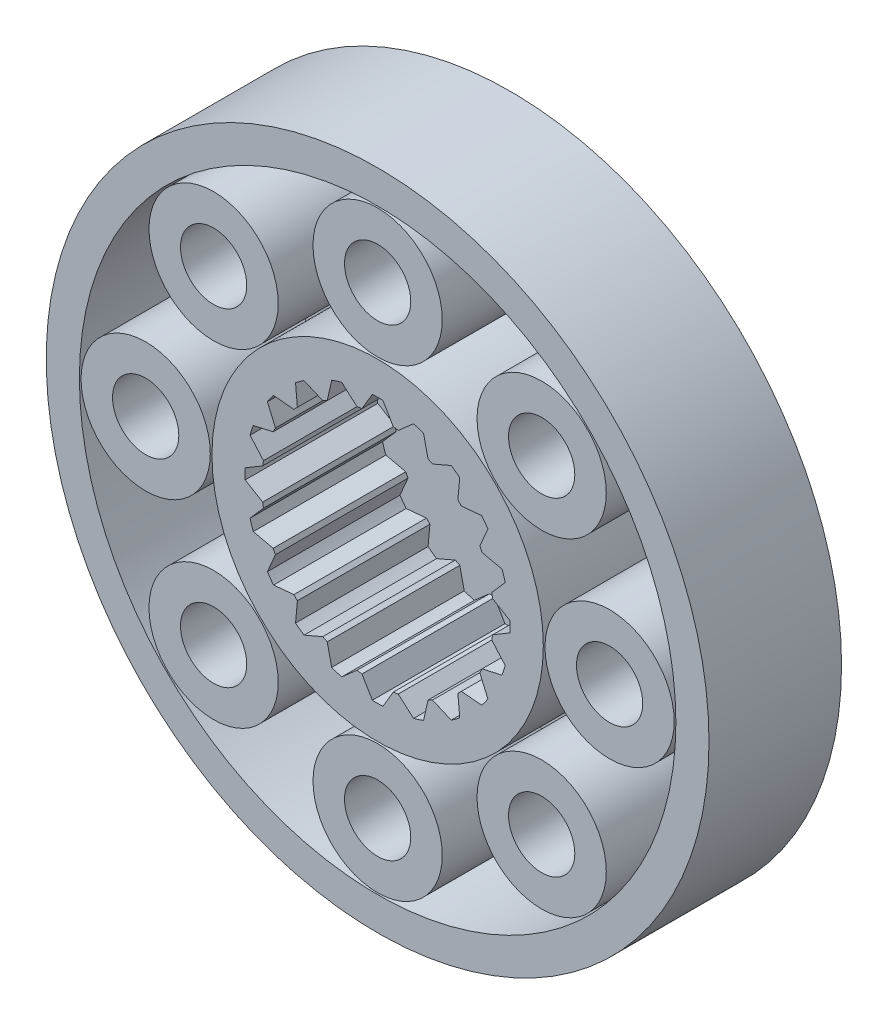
from build123d import *

# Parameters (mm, degrees)
SKETCH1_R            = 10
BOSS_EXTRUDE1_DEPTH  = 4
CUT_EXTRUDE5_START   = -0.5
SKETCH5_R            = 9
SKETCH5_R_2          = 1.95
SKETCH5_R_3          = 5
CUT_EXTRUDE5_DEPTH   = 3.5
CUT_EXTRUDE7_REACH   = 16.697
SKETCH8_R            = 4
SKETCH8_R_2          = 1
SKETCH10_R           = 4.5
BOSS_EXTRUDE12_DEPTH = 0.2
FILLET2_R            = 0.1
CUT_EXTRUDE8_REACH   = 16.753
SKETCH11_R           = 1.5
BOSS_EXTRUDE13_START = 4
BOSS_EXTRUDE13_DEPTH = 4


with BuildPart() as part:
    # Sketch1 → Boss-Extrude1 (new body)
    with BuildSketch(Plane.XY):
        Circle(SKETCH1_R)
    extrude(amount=BOSS_EXTRUDE1_DEPTH)

    # Sketch5 → Cut-Extrude5 (cut)
    with BuildSketch(Plane(origin=(0, 0, 0), x_dir=(-1, 0, 0), z_dir=(0, 0, -1)).offset(CUT_EXTRUDE5_START)):
        Circle(SKETCH5_R)
        with Locations((0, 7)):
            Circle(SKETCH5_R_2, mode=Mode.SUBTRACT)
        Circle(SKETCH5_R_3, mode=Mode.SUBTRACT)
        with Locations((4.949747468, 4.949747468)):
            Circle(SKETCH5_R_2, mode=Mode.SUBTRACT)
        with Locations((7, 0)):
            Circle(SKETCH5_R_2, mode=Mode.SUBTRACT)
        with Locations((4.949747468, -4.949747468)):
            Circle(SKETCH5_R_2, mode=Mode.SUBTRACT)
        with Locations((0, -7)):
            Circle(SKETCH5_R_2, mode=Mode.SUBTRACT)
        with Locations((-4.949747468, -4.949747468)):
            Circle(SKETCH5_R_2, mode=Mode.SUBTRACT)
        with Locations((-7, 0)):
            Circle(SKETCH5_R_2, mode=Mode.SUBTRACT)
        with Locations((-4.949747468, 4.949747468)):
            Circle(SKETCH5_R_2, mode=Mode.SUBTRACT)
    extrude(amount=-CUT_EXTRUDE5_DEPTH, mode=Mode.SUBTRACT)

    # Sketch8 → Cut-Extrude7 (cut, up to next)
    with BuildSketch(Plane.XY.offset(4), mode=Mode.PRIVATE) as cut_extrude7_sk1:
        Circle(SKETCH8_R)
    cut_extrude7_tool1 = extrude(cut_extrude7_sk1.sketch, amount=-CUT_EXTRUDE7_REACH, mode=Mode.PRIVATE) & part.part
    # Sketch8 → Cut-Extrude7 (cut, up to next)
    with BuildSketch(Plane.XY.offset(4), mode=Mode.PRIVATE) as cut_extrude7_sk2:
        with Locations((0, 7)):
            Circle(SKETCH8_R_2)
    cut_extrude7_tool2 = extrude(cut_extrude7_sk2.sketch, amount=-CUT_EXTRUDE7_REACH, mode=Mode.PRIVATE) & part.part
    # Sketch8 → Cut-Extrude7 (cut, up to next)
    with BuildSketch(Plane.XY.offset(4), mode=Mode.PRIVATE) as cut_extrude7_sk3:
        with Locations((4.949747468, 4.949747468)):
            Circle(SKETCH8_R_2)
    cut_extrude7_tool3 = extrude(cut_extrude7_sk3.sketch, amount=-CUT_EXTRUDE7_REACH, mode=Mode.PRIVATE) & part.part
    # Sketch8 → Cut-Extrude7 (cut, up to next)
    with BuildSketch(Plane.XY.offset(4), mode=Mode.PRIVATE) as cut_extrude7_sk4:
        with Locations((7, 0)):
            Circle(SKETCH8_R_2)
    cut_extrude7_tool4 = extrude(cut_extrude7_sk4.sketch, amount=-CUT_EXTRUDE7_REACH, mode=Mode.PRIVATE) & part.part
    # Sketch8 → Cut-Extrude7 (cut, up to next)
    with BuildSketch(Plane.XY.offset(4), mode=Mode.PRIVATE) as cut_extrude7_sk5:
        with Locations((4.949747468, -4.949747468)):
            Circle(SKETCH8_R_2)
    cut_extrude7_tool5 = extrude(cut_extrude7_sk5.sketch, amount=-CUT_EXTRUDE7_REACH, mode=Mode.PRIVATE) & part.part
    # Sketch8 → Cut-Extrude7 (cut, up to next)
    with BuildSketch(Plane.XY.offset(4), mode=Mode.PRIVATE) as cut_extrude7_sk6:
        with Locations((0, -7)):
            Circle(SKETCH8_R_2)
    cut_extrude7_tool6 = extrude(cut_extrude7_sk6.sketch, amount=-CUT_EXTRUDE7_REACH, mode=Mode.PRIVATE) & part.part
    # Sketch8 → Cut-Extrude7 (cut, up to next)
    with BuildSketch(Plane.XY.offset(4), mode=Mode.PRIVATE) as cut_extrude7_sk7:
        with Locations((-4.949747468, -4.949747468)):
            Circle(SKETCH8_R_2)
    cut_extrude7_tool7 = extrude(cut_extrude7_sk7.sketch, amount=-CUT_EXTRUDE7_REACH, mode=Mode.PRIVATE) & part.part
    # Sketch8 → Cut-Extrude7 (cut, up to next)
    with BuildSketch(Plane.XY.offset(4), mode=Mode.PRIVATE) as cut_extrude7_sk8:
        with Locations((-7, 0)):
            Circle(SKETCH8_R_2)
    cut_extrude7_tool8 = extrude(cut_extrude7_sk8.sketch, amount=-CUT_EXTRUDE7_REACH, mode=Mode.PRIVATE) & part.part
    # Sketch8 → Cut-Extrude7 (cut, up to next)
    with BuildSketch(Plane.XY.offset(4), mode=Mode.PRIVATE) as cut_extrude7_sk9:
        with Locations((-4.949747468, 4.949747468)):
            Circle(SKETCH8_R_2)
    cut_extrude7_tool9 = extrude(cut_extrude7_sk9.sketch, amount=-CUT_EXTRUDE7_REACH, mode=Mode.PRIVATE) & part.part
    add(cut_extrude7_tool1.solids().sort_by_distance((0, 0, 4))[0], mode=Mode.SUBTRACT)
    add(cut_extrude7_tool2.solids().sort_by_distance((0, 7, 4))[0], mode=Mode.SUBTRACT)
    add(cut_extrude7_tool3.solids().sort_by_distance((4.949747, 4.949747, 4))[0], mode=Mode.SUBTRACT)
    add(cut_extrude7_tool4.solids().sort_by_distance((7, 0, 4))[0], mode=Mode.SUBTRACT)
    add(cut_extrude7_tool5.solids().sort_by_distance((4.949747, -4.949747, 4))[0], mode=Mode.SUBTRACT)
    add(cut_extrude7_tool6.solids().sort_by_distance((0, -7, 4))[0], mode=Mode.SUBTRACT)
    add(cut_extrude7_tool7.solids().sort_by_distance((-4.949747, -4.949747, 4))[0], mode=Mode.SUBTRACT)
    add(cut_extrude7_tool8.solids().sort_by_distance((-7, 0, 4))[0], mode=Mode.SUBTRACT)
    add(cut_extrude7_tool9.solids().sort_by_distance((-4.949747, 4.949747, 4))[0], mode=Mode.SUBTRACT)

    # Sketch10 → Boss-Extrude12 (add)
    with BuildSketch(Plane(origin=(0, 0, 0), x_dir=(-1, 0, 0), z_dir=(0, 0, -1))):
        with Locations(Location((0, 0, 0), (0, 0, 180))):
            Circle(SKETCH10_R)
    extrude(amount=BOSS_EXTRUDE12_DEPTH)

    # Fillet2
    fillet2_edges = [part.edges().sort_by_distance(p)[0] for p in [
        (-4.5, 0, -0.2),
    ]]
    fillet(fillet2_edges, radius=FILLET2_R)

    # Sketch11 → Cut-Extrude8 (cut, up to next)
    with BuildSketch(Plane(origin=(0, 0, -0.2), x_dir=(-1, 0, 0), z_dir=(0, 0, -1)), mode=Mode.PRIVATE) as cut_extrude8_sk1:
        Circle(SKETCH11_R)
    cut_extrude8_tool1 = extrude(cut_extrude8_sk1.sketch, amount=-CUT_EXTRUDE8_REACH, mode=Mode.PRIVATE) & part.part
    add(cut_extrude8_tool1.solids().sort_by_distance((0, 0, -0.2))[0], mode=Mode.SUBTRACT)

    # Sketch12 → Boss-Extrude13 (add)
    with BuildSketch(Plane.XY.offset(BOSS_EXTRUDE13_START)):
        with BuildLine():
            Line((-0.158746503, 3.996848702), (-0.472857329, 3.467910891))
            ThreePointArc((-0.472857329, 3.467910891), (-0.547520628, 3.456909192), (-0.621929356, 3.444300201))
            Line((-0.621929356, 3.444300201), (-1.084117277, 3.85028437))
            ThreePointArc((-1.084117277, 3.85028437), (-0.62573786, 3.950753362), (-0.158746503, 3.996848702))
        make_face()
        with BuildLine():
            Line((0.158746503, 3.996848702), (0.472857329, 3.467910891))
            ThreePointArc((0.472857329, 3.467910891), (0.547520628, 3.456909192), (0.621929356, 3.444300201))
            Line((0.621929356, 3.444300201), (1.084117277, 3.85028437))
            ThreePointArc((1.084117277, 3.85028437), (0.62573786, 3.950753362), (0.158746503, 3.996848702))
        make_face()
        with BuildLine():
            Line((1.386071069, 3.752173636), (1.521357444, 3.1520583))
            ThreePointArc((1.521357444, 3.1520583), (1.588966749, 3.118522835), (1.655837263, 3.08353741))
            Line((1.655837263, 3.08353741), (2.220860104, 3.326827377))
            ThreePointArc((2.220860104, 3.326827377), (1.815961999, 3.564026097), (1.386071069, 3.752173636))
        make_face()
        with BuildLine():
            Line((2.477717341, 3.140209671), (2.420936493, 2.527660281))
            ThreePointArc((2.420936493, 2.527660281), (2.474873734, 2.474873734), (2.527660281, 2.420936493))
            Line((2.527660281, 2.420936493), (3.140209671, 2.477717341))
            ThreePointArc((3.140209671, 2.477717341), (2.828427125, 2.828427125), (2.477717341, 3.140209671))
        make_face()
        with BuildLine():
            Line((3.326827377, 2.220860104), (3.08353741, 1.655837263))
            ThreePointArc((3.08353741, 1.655837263), (3.118522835, 1.588966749), (3.1520583, 1.521357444))
            Line((3.1520583, 1.521357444), (3.752173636, 1.386071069))
            ThreePointArc((3.752173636, 1.386071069), (3.564026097, 1.815961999), (3.326827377, 2.220860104))
        make_face()
        with BuildLine():
            Line((3.85028437, 1.084117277), (3.444300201, 0.621929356))
            ThreePointArc((3.444300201, 0.621929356), (3.456909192, 0.547520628), (3.467910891, 0.472857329))
            Line((3.467910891, 0.472857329), (3.996848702, 0.158746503))
            ThreePointArc((3.996848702, 0.158746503), (3.950753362, 0.62573786), (3.85028437, 1.084117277))
        make_face()
        with BuildLine():
            Line((3.996848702, -0.158746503), (3.467910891, -0.472857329))
            ThreePointArc((3.467910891, -0.472857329), (3.456909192, -0.547520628), (3.444300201, -0.621929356))
            Line((3.444300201, -0.621929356), (3.85028437, -1.084117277))
            ThreePointArc((3.85028437, -1.084117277), (3.950753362, -0.62573786), (3.996848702, -0.158746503))
        make_face()
        with BuildLine():
            Line((3.752173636, -1.386071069), (3.1520583, -1.521357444))
            ThreePointArc((3.1520583, -1.521357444), (3.118522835, -1.588966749), (3.08353741, -1.655837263))
            Line((3.08353741, -1.655837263), (3.326827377, -2.220860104))
            ThreePointArc((3.326827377, -2.220860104), (3.564026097, -1.815961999), (3.752173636, -1.386071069))
        make_face()
        with BuildLine():
            Line((3.140209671, -2.477717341), (2.527660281, -2.420936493))
            ThreePointArc((2.527660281, -2.420936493), (2.474873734, -2.474873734), (2.420936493, -2.527660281))
            Line((2.420936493, -2.527660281), (2.477717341, -3.140209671))
            ThreePointArc((2.477717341, -3.140209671), (2.828427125, -2.828427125), (3.140209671, -2.477717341))
        make_face()
        with BuildLine():
            Line((2.220860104, -3.326827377), (1.655837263, -3.08353741))
            ThreePointArc((1.655837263, -3.08353741), (1.588966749, -3.118522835), (1.521357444, -3.1520583))
            Line((1.521357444, -3.1520583), (1.386071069, -3.752173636))
            ThreePointArc((1.386071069, -3.752173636), (1.815961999, -3.564026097), (2.220860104, -3.326827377))
        make_face()
        with BuildLine():
            Line((1.084117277, -3.85028437), (0.621929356, -3.444300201))
            ThreePointArc((0.621929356, -3.444300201), (0.547520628, -3.456909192), (0.472857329, -3.467910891))
            Line((0.472857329, -3.467910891), (0.158746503, -3.996848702))
            ThreePointArc((0.158746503, -3.996848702), (0.62573786, -3.950753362), (1.084117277, -3.85028437))
        make_face()
        with BuildLine():
            Line((-0.158746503, -3.996848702), (-0.472857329, -3.467910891))
            ThreePointArc((-0.472857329, -3.467910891), (-0.547520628, -3.456909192), (-0.621929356, -3.444300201))
            Line((-0.621929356, -3.444300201), (-1.084117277, -3.85028437))
            ThreePointArc((-1.084117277, -3.85028437), (-0.62573786, -3.950753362), (-0.158746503, -3.996848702))
        make_face()
        with BuildLine():
            Line((-1.386071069, -3.752173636), (-1.521357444, -3.1520583))
            ThreePointArc((-1.521357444, -3.1520583), (-1.588966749, -3.118522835), (-1.655837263, -3.08353741))
            Line((-1.655837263, -3.08353741), (-2.220860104, -3.326827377))
            ThreePointArc((-2.220860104, -3.326827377), (-1.815961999, -3.564026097), (-1.386071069, -3.752173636))
        make_face()
        with BuildLine():
            Line((-2.477717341, -3.140209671), (-2.420936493, -2.527660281))
            ThreePointArc((-2.420936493, -2.527660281), (-2.474873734, -2.474873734), (-2.527660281, -2.420936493))
            Line((-2.527660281, -2.420936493), (-3.140209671, -2.477717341))
            ThreePointArc((-3.140209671, -2.477717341), (-2.828427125, -2.828427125), (-2.477717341, -3.140209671))
        make_face()
        with BuildLine():
            Line((-3.326827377, -2.220860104), (-3.08353741, -1.655837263))
            ThreePointArc((-3.08353741, -1.655837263), (-3.118522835, -1.588966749), (-3.1520583, -1.521357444))
            Line((-3.1520583, -1.521357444), (-3.752173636, -1.386071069))
            ThreePointArc((-3.752173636, -1.386071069), (-3.564026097, -1.815961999), (-3.326827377, -2.220860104))
        make_face()
        with BuildLine():
            Line((-3.85028437, -1.084117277), (-3.444300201, -0.621929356))
            ThreePointArc((-3.444300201, -0.621929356), (-3.456909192, -0.547520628), (-3.467910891, -0.472857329))
            Line((-3.467910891, -0.472857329), (-3.996848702, -0.158746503))
            ThreePointArc((-3.996848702, -0.158746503), (-3.950753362, -0.62573786), (-3.85028437, -1.084117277))
        make_face()
        with BuildLine():
            Line((-3.996848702, 0.158746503), (-3.467910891, 0.472857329))
            ThreePointArc((-3.467910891, 0.472857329), (-3.456909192, 0.547520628), (-3.444300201, 0.621929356))
            Line((-3.444300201, 0.621929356), (-3.85028437, 1.084117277))
            ThreePointArc((-3.85028437, 1.084117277), (-3.950753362, 0.62573786), (-3.996848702, 0.158746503))
        make_face()
        with BuildLine():
            Line((-3.752173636, 1.386071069), (-3.1520583, 1.521357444))
            ThreePointArc((-3.1520583, 1.521357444), (-3.118522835, 1.588966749), (-3.08353741, 1.655837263))
            Line((-3.08353741, 1.655837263), (-3.326827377, 2.220860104))
            ThreePointArc((-3.326827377, 2.220860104), (-3.564026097, 1.815961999), (-3.752173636, 1.386071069))
        make_face()
        with BuildLine():
            Line((-3.140209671, 2.477717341), (-2.527660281, 2.420936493))
            ThreePointArc((-2.527660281, 2.420936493), (-2.474873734, 2.474873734), (-2.420936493, 2.527660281))
            Line((-2.420936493, 2.527660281), (-2.477717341, 3.140209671))
            ThreePointArc((-2.477717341, 3.140209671), (-2.828427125, 2.828427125), (-3.140209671, 2.477717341))
        make_face()
        with BuildLine():
            Line((-2.220860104, 3.326827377), (-1.655837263, 3.08353741))
            ThreePointArc((-1.655837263, 3.08353741), (-1.588966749, 3.118522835), (-1.521357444, 3.1520583))
            Line((-1.521357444, 3.1520583), (-1.386071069, 3.752173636))
            ThreePointArc((-1.386071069, 3.752173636), (-1.815961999, 3.564026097), (-2.220860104, 3.326827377))
        make_face()
    extrude(amount=-BOSS_EXTRUDE13_DEPTH)


solid = part.part
